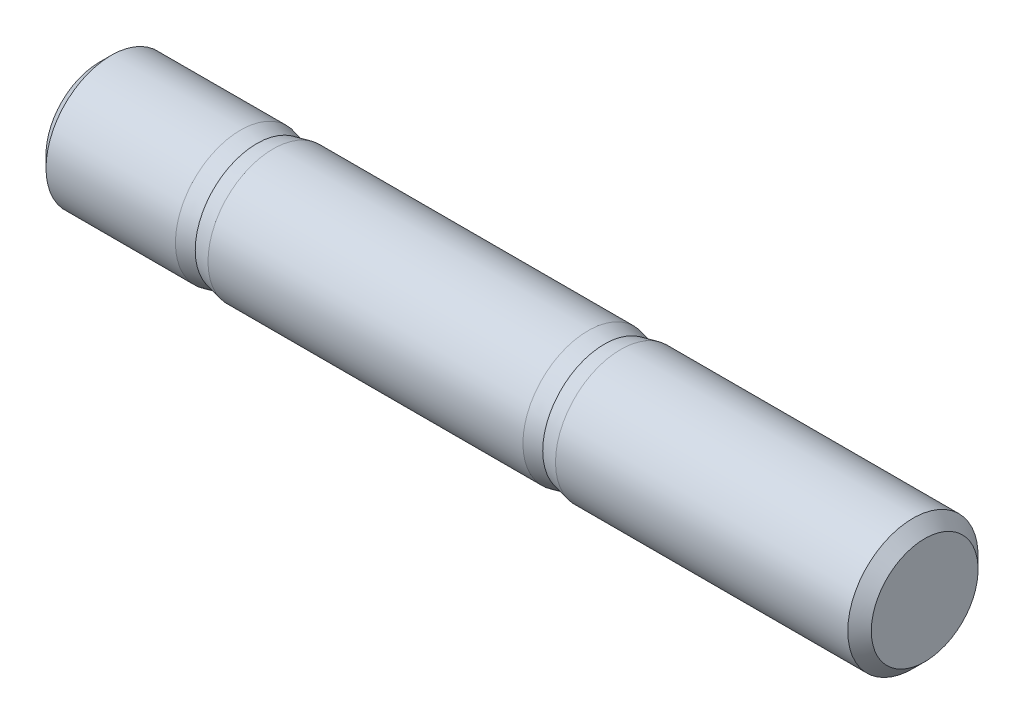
from build123d import *

# Parameters (mm, degrees)
HEADCHAMFER_SIZE = 0.5415


with BuildPart() as part:
    # Sketch1 → BaseHead (revolve)
    with BuildSketch(Plane.XY, mode=Mode.PRIVATE) as basehead_sk:
        Polygon((0, 0), (0, 3), (6.5, 3), (8, 2.675), (22.5, 2.675), (24, 3), (38, 3), (38, 0), align=None)
    revolve(basehead_sk.sketch.rotate(Axis((-1.310841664, 0, 0), (1, 0, 0)), 90), axis=Axis((-1.310841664, 0, 0), (1, 0, 0)))

    # HeadChamfer
    headchamfer_edges = [part.edges().sort_by_distance(p)[0] for p in [
        (38, 0, -3),
        (0, 0, -3),
    ]]
    chamfer(headchamfer_edges, length=HEADCHAMFER_SIZE)

    # Sketch2 → BaseBody (revolve)
    with BuildSketch(Plane.XY, mode=Mode.PRIVATE) as basebody_sk:
        Polygon((6.5, 2.675), (8, 3), (22.5, 3), (24, 2.675), align=None)
    revolve(basebody_sk.sketch.rotate(Axis((-1.310841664, 0, 0), (1, 0, 0)), 90), axis=Axis((-1.310841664, 0, 0), (1, 0, 0)))


solid = part.part
